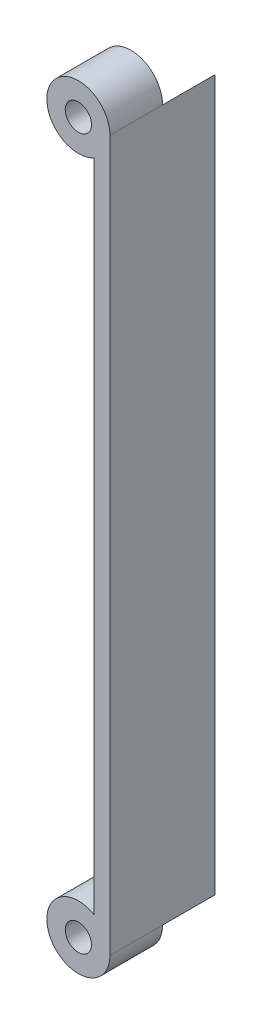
from build123d import *

# Parameters (mm, degrees)
ESQUISSE1_R             = 2.5
BOSS_EXTRU_1_DEPTH      = 20
ESQUISSE2_R             = 6
ENL_V_MAT_EXTRU_1_DEPTH = 10


with BuildPart() as part:
    # Esquisse1 → Boss.-Extru.1 (new body)
    with BuildSketch(Plane.XY):
        with BuildLine():
            Line((6, 135), (6, 0))
            ThreePointArc((6, 0), (-5.196152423, -3), (3, 5.196152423))
            Line((3, 5.196152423), (3, 129.803847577))
            ThreePointArc((3, 129.803847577), (-5.196152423, 138), (6, 135))
        make_face()
        Circle(ESQUISSE1_R, mode=Mode.SUBTRACT)
        with Locations((0, 135)):
            Circle(ESQUISSE1_R, mode=Mode.SUBTRACT)
    extrude(amount=BOSS_EXTRU_1_DEPTH)

    # Esquisse2 → Enl_v. mat.-Extru.1 (cut)
    with BuildSketch(Plane(origin=(0, 0, 0), x_dir=(-1, 0, 0), z_dir=(0, 0, -1))):
        Circle(ESQUISSE2_R)
        with Locations((0, 135)):
            Circle(ESQUISSE2_R)
    extrude(amount=-ENL_V_MAT_EXTRU_1_DEPTH, mode=Mode.SUBTRACT)


solid = part.part
